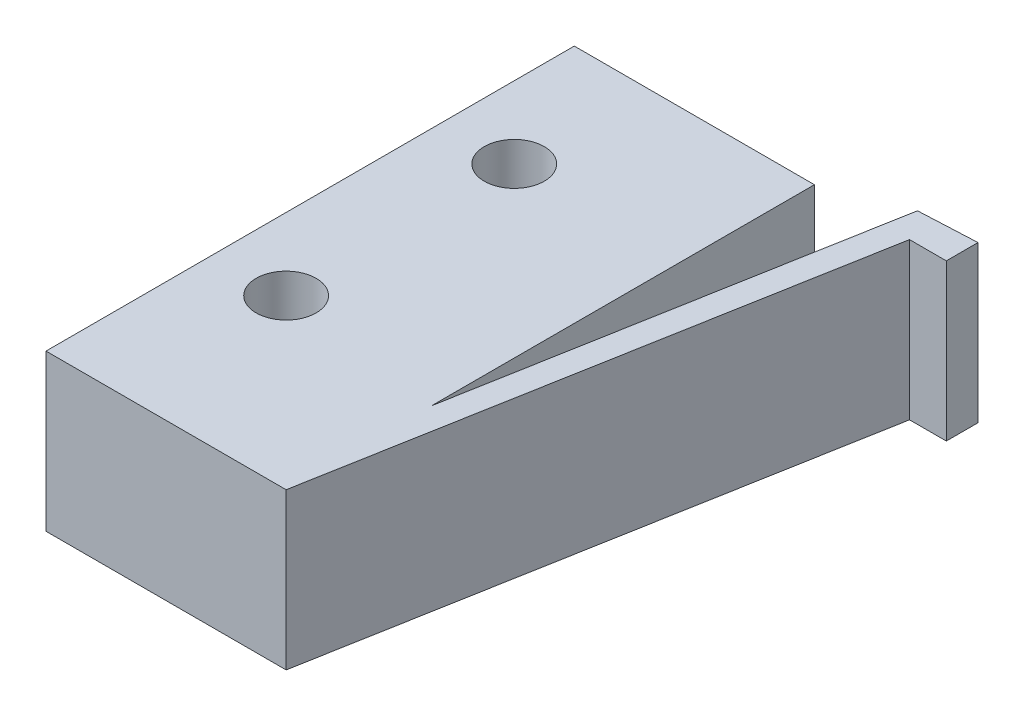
ISO-10303-21;
HEADER;
FILE_DESCRIPTION(('STEP AP214'),'2;1');
FILE_NAME('part.step','',(''),(''),'','','');
FILE_SCHEMA(('AUTOMOTIVE_DESIGN { 1 0 10303 214 1 1 1 1 }'));
ENDSEC;
DATA;
#1=APPLICATION_CONTEXT('core data for automotive mechanical design processes');
#2=APPLICATION_PROTOCOL_DEFINITION('international standard','automotive_design',2000,#1);
#3=PRODUCT_CONTEXT('',#1,'mechanical');
#4=PRODUCT('Part','Part','',(#3));
#5=PRODUCT_RELATED_PRODUCT_CATEGORY('part','',(#4));
#6=PRODUCT_DEFINITION_FORMATION('','',#4);
#7=PRODUCT_DEFINITION_CONTEXT('part definition',#1,'design');
#8=PRODUCT_DEFINITION('design','',#6,#7);
#9=PRODUCT_DEFINITION_SHAPE('','',#8);
#10=(LENGTH_UNIT() NAMED_UNIT(*) SI_UNIT(.MILLI.,.METRE.));
#11=(NAMED_UNIT(*) PLANE_ANGLE_UNIT() SI_UNIT($,.RADIAN.));
#12=(NAMED_UNIT(*) SI_UNIT($,.STERADIAN.) SOLID_ANGLE_UNIT());
#13=UNCERTAINTY_MEASURE_WITH_UNIT(LENGTH_MEASURE(1.E-05),#10,'distance_accuracy_value','');
#14=(GEOMETRIC_REPRESENTATION_CONTEXT(3) GLOBAL_UNCERTAINTY_ASSIGNED_CONTEXT((#13)) GLOBAL_UNIT_ASSIGNED_CONTEXT((#10,
#11,#12)) REPRESENTATION_CONTEXT('',''));
#15=CARTESIAN_POINT('',(0.,0.,0.));
#16=DIRECTION('',(0.,0.,1.));
#17=DIRECTION('',(1.,0.,0.));
#18=AXIS2_PLACEMENT_3D('',#15,#16,#17);
#19=CARTESIAN_POINT('',(0.,3.25,0.));
#20=DIRECTION('',(0.,-1.,0.));
#21=DIRECTION('',(0.,0.,-1.));
#22=AXIS2_PLACEMENT_3D('',#19,#20,#21);
#23=PLANE('',#22);
#24=DIRECTION('',(-0.177146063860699,0.,0.984184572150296));
#25=VECTOR('',#24,1.);
#26=CARTESIAN_POINT('',(8.08680450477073,3.25,-12.2043300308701));
#27=LINE('',#26,#25);
#28=CARTESIAN_POINT('',(8.08680450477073,3.25,-12.2043300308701));
#29=VERTEX_POINT('',#28);
#30=CARTESIAN_POINT('',(5.,3.25,4.94527693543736));
#31=VERTEX_POINT('',#30);
#32=EDGE_CURVE('E126',#29,#31,#27,.T.);
#33=ORIENTED_EDGE('',*,*,#32,.T.);
#34=DIRECTION('',(0.,0.,-1.));
#35=VECTOR('',#34,1.);
#36=CARTESIAN_POINT('',(5.,3.25,11.));
#37=LINE('',#36,#35);
#38=CARTESIAN_POINT('',(5.,3.25,-11.));
#39=VERTEX_POINT('',#38);
#40=EDGE_CURVE('E47',#31,#39,#37,.T.);
#41=ORIENTED_EDGE('',*,*,#40,.T.);
#42=DIRECTION('',(-1.,0.,0.));
#43=VECTOR('',#42,1.);
#44=CARTESIAN_POINT('',(-5.,3.25,-11.));
#45=LINE('',#44,#43);
#46=CARTESIAN_POINT('',(-5.,3.25,-11.));
#47=VERTEX_POINT('',#46);
#48=EDGE_CURVE('E161',#39,#47,#45,.T.);
#49=ORIENTED_EDGE('',*,*,#48,.T.);
#50=DIRECTION('',(0.,0.,1.));
#51=VECTOR('',#50,1.);
#52=CARTESIAN_POINT('',(-5.,3.25,11.));
#53=LINE('',#52,#51);
#54=CARTESIAN_POINT('',(-5.,3.25,11.));
#55=VERTEX_POINT('',#54);
#56=EDGE_CURVE('E164',#47,#55,#53,.T.);
#57=ORIENTED_EDGE('',*,*,#56,.T.);
#58=DIRECTION('',(1.,0.,0.));
#59=VECTOR('',#58,1.);
#60=CARTESIAN_POINT('',(-5.,3.25,11.));
#61=LINE('',#60,#59);
#62=CARTESIAN_POINT('',(5.,3.25,11.));
#63=VERTEX_POINT('',#62);
#64=EDGE_CURVE('E166',#55,#63,#61,.T.);
#65=ORIENTED_EDGE('',*,*,#64,.T.);
#66=DIRECTION('',(0.177146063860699,0.,-0.984184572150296));
#67=VECTOR('',#66,1.);
#68=CARTESIAN_POINT('',(5.,3.25,11.));
#69=LINE('',#68,#67);
#70=CARTESIAN_POINT('',(8.95983996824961,3.25,-11.));
#71=VERTEX_POINT('',#70);
#72=EDGE_CURVE('E133',#63,#71,#69,.T.);
#73=ORIENTED_EDGE('',*,*,#72,.T.);
#74=DIRECTION('',(1.,0.,0.));
#75=VECTOR('',#74,1.);
#76=CARTESIAN_POINT('',(8.95983996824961,3.25,-11.));
#77=LINE('',#76,#75);
#78=CARTESIAN_POINT('',(10.4917701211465,3.25,-11.));
#79=VERTEX_POINT('',#78);
#80=EDGE_CURVE('E118',#71,#79,#77,.T.);
#81=ORIENTED_EDGE('',*,*,#80,.T.);
#82=DIRECTION('',(0.,0.,-1.));
#83=VECTOR('',#82,1.);
#84=CARTESIAN_POINT('',(10.4917701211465,3.25,-11.));
#85=LINE('',#84,#83);
#86=CARTESIAN_POINT('',(10.4917701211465,3.25,-12.3196366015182));
#87=VERTEX_POINT('',#86);
#88=EDGE_CURVE('E209',#79,#87,#85,.T.);
#89=ORIENTED_EDGE('',*,*,#88,.T.);
#90=DIRECTION('',(-0.99885260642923,0.,0.0478901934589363));
#91=VECTOR('',#90,1.);
#92=CARTESIAN_POINT('',(10.4917701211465,3.25,-12.3196366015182));
#93=LINE('',#92,#91);
#94=EDGE_CURVE('E129',#87,#29,#93,.T.);
#95=ORIENTED_EDGE('',*,*,#94,.T.);
#96=EDGE_LOOP('',(#33,#41,#49,#57,#65,#73,#81,#89,#95));
#97=FACE_BOUND('',#96,.T.);
#98=CARTESIAN_POINT('',(-2.,3.25,-5.5));
#99=DIRECTION('',(0.,1.,0.));
#100=DIRECTION('',(0.,0.,1.));
#101=AXIS2_PLACEMENT_3D('',#98,#99,#100);
#102=CIRCLE('',#101,1.25);
#103=CARTESIAN_POINT('',(-2.,3.25,-6.75));
#104=VERTEX_POINT('',#103);
#105=EDGE_CURVE('E154',#104,#104,#102,.T.);
#106=ORIENTED_EDGE('',*,*,#105,.F.);
#107=EDGE_LOOP('',(#106));
#108=FACE_BOUND('',#107,.T.);
#109=CARTESIAN_POINT('',(-2.,3.25,4.));
#110=DIRECTION('',(0.,1.,0.));
#111=DIRECTION('',(0.,0.,1.));
#112=AXIS2_PLACEMENT_3D('',#109,#110,#111);
#113=CIRCLE('',#112,1.25);
#114=CARTESIAN_POINT('',(-2.,3.25,2.75));
#115=VERTEX_POINT('',#114);
#116=EDGE_CURVE('E148',#115,#115,#113,.T.);
#117=ORIENTED_EDGE('',*,*,#116,.F.);
#118=EDGE_LOOP('',(#117));
#119=FACE_BOUND('',#118,.T.);
#120=ADVANCED_FACE('F33',(#97,#108,#119),#23,.F.);
#121=CARTESIAN_POINT('',(0.,-3.25,0.));
#122=DIRECTION('',(0.,-1.,0.));
#123=DIRECTION('',(0.,0.,-1.));
#124=AXIS2_PLACEMENT_3D('',#121,#122,#123);
#125=PLANE('',#124);
#126=DIRECTION('',(0.,0.,-1.));
#127=VECTOR('',#126,1.);
#128=CARTESIAN_POINT('',(5.,-3.25,11.));
#129=LINE('',#128,#127);
#130=CARTESIAN_POINT('',(5.,-3.25,4.94527693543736));
#131=VERTEX_POINT('',#130);
#132=CARTESIAN_POINT('',(5.,-3.25,-11.));
#133=VERTEX_POINT('',#132);
#134=EDGE_CURVE('E157',#131,#133,#129,.T.);
#135=ORIENTED_EDGE('',*,*,#134,.F.);
#136=DIRECTION('',(-0.177146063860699,0.,0.984184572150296));
#137=VECTOR('',#136,1.);
#138=CARTESIAN_POINT('',(8.08680450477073,-3.25,-12.2043300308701));
#139=LINE('',#138,#137);
#140=CARTESIAN_POINT('',(8.08680450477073,-3.25,-12.2043300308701));
#141=VERTEX_POINT('',#140);
#142=EDGE_CURVE('E135',#141,#131,#139,.T.);
#143=ORIENTED_EDGE('',*,*,#142,.F.);
#144=DIRECTION('',(-0.99885260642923,0.,0.0478901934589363));
#145=VECTOR('',#144,1.);
#146=CARTESIAN_POINT('',(10.4917701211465,-3.25,-12.3196366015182));
#147=LINE('',#146,#145);
#148=CARTESIAN_POINT('',(10.4917701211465,-3.25,-12.3196366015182));
#149=VERTEX_POINT('',#148);
#150=EDGE_CURVE('E140',#149,#141,#147,.T.);
#151=ORIENTED_EDGE('',*,*,#150,.F.);
#152=DIRECTION('',(0.,0.,-1.));
#153=VECTOR('',#152,1.);
#154=CARTESIAN_POINT('',(10.4917701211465,-3.25,-11.));
#155=LINE('',#154,#153);
#156=CARTESIAN_POINT('',(10.4917701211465,-3.25,-11.));
#157=VERTEX_POINT('',#156);
#158=EDGE_CURVE('E109',#157,#149,#155,.T.);
#159=ORIENTED_EDGE('',*,*,#158,.F.);
#160=DIRECTION('',(1.,0.,0.));
#161=VECTOR('',#160,1.);
#162=CARTESIAN_POINT('',(8.95983996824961,-3.25,-11.));
#163=LINE('',#162,#161);
#164=CARTESIAN_POINT('',(8.95983996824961,-3.25,-11.));
#165=VERTEX_POINT('',#164);
#166=EDGE_CURVE('E100',#165,#157,#163,.T.);
#167=ORIENTED_EDGE('',*,*,#166,.F.);
#168=DIRECTION('',(0.177146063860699,0.,-0.984184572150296));
#169=VECTOR('',#168,1.);
#170=CARTESIAN_POINT('',(5.,-3.25,11.));
#171=LINE('',#170,#169);
#172=CARTESIAN_POINT('',(5.,-3.25,11.));
#173=VERTEX_POINT('',#172);
#174=EDGE_CURVE('E106',#173,#165,#171,.T.);
#175=ORIENTED_EDGE('',*,*,#174,.F.);
#176=DIRECTION('',(1.,0.,0.));
#177=VECTOR('',#176,1.);
#178=CARTESIAN_POINT('',(-5.,-3.25,11.));
#179=LINE('',#178,#177);
#180=CARTESIAN_POINT('',(-5.,-3.25,11.));
#181=VERTEX_POINT('',#180);
#182=EDGE_CURVE('E162',#181,#173,#179,.T.);
#183=ORIENTED_EDGE('',*,*,#182,.F.);
#184=DIRECTION('',(0.,0.,1.));
#185=VECTOR('',#184,1.);
#186=CARTESIAN_POINT('',(-5.,-3.25,11.));
#187=LINE('',#186,#185);
#188=CARTESIAN_POINT('',(-5.,-3.25,-11.));
#189=VERTEX_POINT('',#188);
#190=EDGE_CURVE('E171',#189,#181,#187,.T.);
#191=ORIENTED_EDGE('',*,*,#190,.F.);
#192=DIRECTION('',(-1.,0.,0.));
#193=VECTOR('',#192,1.);
#194=CARTESIAN_POINT('',(-5.,-3.25,-11.));
#195=LINE('',#194,#193);
#196=EDGE_CURVE('E169',#133,#189,#195,.T.);
#197=ORIENTED_EDGE('',*,*,#196,.F.);
#198=EDGE_LOOP('',(#135,#143,#151,#159,#167,#175,#183,#191,#197));
#199=FACE_BOUND('',#198,.T.);
#200=CARTESIAN_POINT('',(-2.,-3.25,-5.5));
#201=DIRECTION('',(0.,1.,0.));
#202=DIRECTION('',(0.,0.,1.));
#203=AXIS2_PLACEMENT_3D('',#200,#201,#202);
#204=CIRCLE('',#203,1.25);
#205=CARTESIAN_POINT('',(-2.,-3.25,-6.75));
#206=VERTEX_POINT('',#205);
#207=EDGE_CURVE('E151',#206,#206,#204,.T.);
#208=ORIENTED_EDGE('',*,*,#207,.T.);
#209=EDGE_LOOP('',(#208));
#210=FACE_BOUND('',#209,.T.);
#211=CARTESIAN_POINT('',(-2.,-3.25,4.));
#212=DIRECTION('',(0.,1.,0.));
#213=DIRECTION('',(0.,0.,1.));
#214=AXIS2_PLACEMENT_3D('',#211,#212,#213);
#215=CIRCLE('',#214,1.25);
#216=CARTESIAN_POINT('',(-2.,-3.25,2.75));
#217=VERTEX_POINT('',#216);
#218=EDGE_CURVE('E138',#217,#217,#215,.T.);
#219=ORIENTED_EDGE('',*,*,#218,.T.);
#220=EDGE_LOOP('',(#219));
#221=FACE_BOUND('',#220,.T.);
#222=ADVANCED_FACE('F102',(#199,#210,#221),#125,.T.);
#223=CARTESIAN_POINT('',(5.,3.25,11.));
#224=DIRECTION('',(-1.,0.,0.));
#225=DIRECTION('',(0.,0.,1.));
#226=AXIS2_PLACEMENT_3D('',#223,#224,#225);
#227=PLANE('',#226);
#228=ORIENTED_EDGE('',*,*,#40,.F.);
#229=DIRECTION('',(0.,-1.,0.));
#230=VECTOR('',#229,1.);
#231=CARTESIAN_POINT('',(5.,3.25,4.94527693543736));
#232=LINE('',#231,#230);
#233=EDGE_CURVE('E11',#31,#131,#232,.T.);
#234=ORIENTED_EDGE('',*,*,#233,.T.);
#235=ORIENTED_EDGE('',*,*,#134,.T.);
#236=DIRECTION('',(0.,-1.,0.));
#237=VECTOR('',#236,1.);
#238=CARTESIAN_POINT('',(5.,3.25,-11.));
#239=LINE('',#238,#237);
#240=EDGE_CURVE('E41',#39,#133,#239,.T.);
#241=ORIENTED_EDGE('',*,*,#240,.F.);
#242=EDGE_LOOP('',(#228,#234,#235,#241));
#243=FACE_BOUND('',#242,.T.);
#244=ADVANCED_FACE('F35',(#243),#227,.F.);
#245=CARTESIAN_POINT('',(-5.,3.25,-11.));
#246=DIRECTION('',(0.,0.,1.));
#247=DIRECTION('',(1.,0.,0.));
#248=AXIS2_PLACEMENT_3D('',#245,#246,#247);
#249=PLANE('',#248);
#250=ORIENTED_EDGE('',*,*,#196,.T.);
#251=DIRECTION('',(0.,-1.,0.));
#252=VECTOR('',#251,1.);
#253=CARTESIAN_POINT('',(-5.,3.25,-11.));
#254=LINE('',#253,#252);
#255=EDGE_CURVE('E178',#47,#189,#254,.T.);
#256=ORIENTED_EDGE('',*,*,#255,.F.);
#257=ORIENTED_EDGE('',*,*,#48,.F.);
#258=ORIENTED_EDGE('',*,*,#240,.T.);
#259=EDGE_LOOP('',(#250,#256,#257,#258));
#260=FACE_BOUND('',#259,.T.);
#261=ADVANCED_FACE('F183',(#260),#249,.F.);
#262=CARTESIAN_POINT('',(-5.,3.25,11.));
#263=DIRECTION('',(1.,0.,0.));
#264=DIRECTION('',(0.,0.,-1.));
#265=AXIS2_PLACEMENT_3D('',#262,#263,#264);
#266=PLANE('',#265);
#267=ORIENTED_EDGE('',*,*,#190,.T.);
#268=DIRECTION('',(0.,-1.,0.));
#269=VECTOR('',#268,1.);
#270=CARTESIAN_POINT('',(-5.,3.25,11.));
#271=LINE('',#270,#269);
#272=EDGE_CURVE('E175',#55,#181,#271,.T.);
#273=ORIENTED_EDGE('',*,*,#272,.F.);
#274=ORIENTED_EDGE('',*,*,#56,.F.);
#275=ORIENTED_EDGE('',*,*,#255,.T.);
#276=EDGE_LOOP('',(#267,#273,#274,#275));
#277=FACE_BOUND('',#276,.T.);
#278=ADVANCED_FACE('F189',(#277),#266,.F.);
#279=CARTESIAN_POINT('',(-5.,3.25,11.));
#280=DIRECTION('',(0.,0.,-1.));
#281=DIRECTION('',(-1.,0.,0.));
#282=AXIS2_PLACEMENT_3D('',#279,#280,#281);
#283=PLANE('',#282);
#284=ORIENTED_EDGE('',*,*,#182,.T.);
#285=DIRECTION('',(0.,-1.,0.));
#286=VECTOR('',#285,1.);
#287=CARTESIAN_POINT('',(5.,3.25,11.));
#288=LINE('',#287,#286);
#289=EDGE_CURVE('E125',#63,#173,#288,.T.);
#290=ORIENTED_EDGE('',*,*,#289,.F.);
#291=ORIENTED_EDGE('',*,*,#64,.F.);
#292=ORIENTED_EDGE('',*,*,#272,.T.);
#293=EDGE_LOOP('',(#284,#290,#291,#292));
#294=FACE_BOUND('',#293,.T.);
#295=ADVANCED_FACE('F193',(#294),#283,.F.);
#296=CARTESIAN_POINT('',(-2.,3.25,-5.5));
#297=DIRECTION('',(0.,-1.,0.));
#298=DIRECTION('',(0.,0.,-1.));
#299=AXIS2_PLACEMENT_3D('',#296,#297,#298);
#300=CYLINDRICAL_SURFACE('',#299,1.25);
#301=CARTESIAN_POINT('',(-2.,3.25,-6.75));
#302=CARTESIAN_POINT('',(-2.,3.18229166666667,-6.75));
#303=CARTESIAN_POINT('',(-2.,3.11458333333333,-6.75));
#304=CARTESIAN_POINT('',(-2.,2.97916666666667,-6.75));
#305=CARTESIAN_POINT('',(-2.,2.91145833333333,-6.75));
#306=CARTESIAN_POINT('',(-2.,2.77604166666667,-6.75));
#307=CARTESIAN_POINT('',(-2.,2.70833333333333,-6.75));
#308=CARTESIAN_POINT('',(-2.,2.57291666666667,-6.75));
#309=CARTESIAN_POINT('',(-2.,2.50520833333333,-6.75));
#310=CARTESIAN_POINT('',(-2.,2.36979166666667,-6.75));
#311=CARTESIAN_POINT('',(-2.,2.30208333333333,-6.75));
#312=CARTESIAN_POINT('',(-2.,2.16666666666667,-6.75));
#313=CARTESIAN_POINT('',(-2.,2.09895833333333,-6.75));
#314=CARTESIAN_POINT('',(-2.,1.96354166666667,-6.75));
#315=CARTESIAN_POINT('',(-2.,1.89583333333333,-6.75));
#316=CARTESIAN_POINT('',(-2.,1.76041666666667,-6.75));
#317=CARTESIAN_POINT('',(-2.,1.69270833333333,-6.75));
#318=CARTESIAN_POINT('',(-2.,1.55729166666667,-6.75));
#319=CARTESIAN_POINT('',(-2.,1.48958333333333,-6.75));
#320=CARTESIAN_POINT('',(-2.,1.35416666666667,-6.75));
#321=CARTESIAN_POINT('',(-2.,1.28645833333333,-6.75));
#322=CARTESIAN_POINT('',(-2.,1.15104166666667,-6.75));
#323=CARTESIAN_POINT('',(-2.,1.08333333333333,-6.75));
#324=CARTESIAN_POINT('',(-2.,0.947916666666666,-6.75));
#325=CARTESIAN_POINT('',(-2.,0.880208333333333,-6.75));
#326=CARTESIAN_POINT('',(-2.,0.744791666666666,-6.75));
#327=CARTESIAN_POINT('',(-2.,0.677083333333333,-6.75));
#328=CARTESIAN_POINT('',(-2.,0.541666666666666,-6.75));
#329=CARTESIAN_POINT('',(-2.,0.473958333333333,-6.75));
#330=CARTESIAN_POINT('',(-2.,0.338541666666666,-6.75));
#331=CARTESIAN_POINT('',(-2.,0.270833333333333,-6.75));
#332=CARTESIAN_POINT('',(-2.,0.135416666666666,-6.75));
#333=CARTESIAN_POINT('',(-2.,0.0677083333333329,-6.75));
#334=CARTESIAN_POINT('',(-2.,-0.0677083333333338,-6.75));
#335=CARTESIAN_POINT('',(-2.,-0.135416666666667,-6.75));
#336=CARTESIAN_POINT('',(-2.,-0.270833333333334,-6.75));
#337=CARTESIAN_POINT('',(-2.,-0.338541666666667,-6.75));
#338=CARTESIAN_POINT('',(-2.,-0.473958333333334,-6.75));
#339=CARTESIAN_POINT('',(-2.,-0.541666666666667,-6.75));
#340=CARTESIAN_POINT('',(-2.,-0.677083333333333,-6.75));
#341=CARTESIAN_POINT('',(-2.,-0.744791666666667,-6.75));
#342=CARTESIAN_POINT('',(-2.,-0.880208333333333,-6.75));
#343=CARTESIAN_POINT('',(-2.,-0.947916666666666,-6.75));
#344=CARTESIAN_POINT('',(-2.,-1.08333333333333,-6.75));
#345=CARTESIAN_POINT('',(-2.,-1.15104166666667,-6.75));
#346=CARTESIAN_POINT('',(-2.,-1.28645833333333,-6.75));
#347=CARTESIAN_POINT('',(-2.,-1.35416666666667,-6.75));
#348=CARTESIAN_POINT('',(-2.,-1.48958333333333,-6.75));
#349=CARTESIAN_POINT('',(-2.,-1.55729166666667,-6.75));
#350=CARTESIAN_POINT('',(-2.,-1.69270833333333,-6.75));
#351=CARTESIAN_POINT('',(-2.,-1.76041666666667,-6.75));
#352=CARTESIAN_POINT('',(-2.,-1.89583333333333,-6.75));
#353=CARTESIAN_POINT('',(-2.,-1.96354166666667,-6.75));
#354=CARTESIAN_POINT('',(-2.,-2.09895833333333,-6.75));
#355=CARTESIAN_POINT('',(-2.,-2.16666666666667,-6.75));
#356=CARTESIAN_POINT('',(-2.,-2.30208333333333,-6.75));
#357=CARTESIAN_POINT('',(-2.,-2.36979166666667,-6.75));
#358=CARTESIAN_POINT('',(-2.,-2.50520833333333,-6.75));
#359=CARTESIAN_POINT('',(-2.,-2.57291666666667,-6.75));
#360=CARTESIAN_POINT('',(-2.,-2.70833333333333,-6.75));
#361=CARTESIAN_POINT('',(-2.,-2.77604166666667,-6.75));
#362=CARTESIAN_POINT('',(-2.,-2.91145833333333,-6.75));
#363=CARTESIAN_POINT('',(-2.,-2.97916666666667,-6.75));
#364=CARTESIAN_POINT('',(-2.,-3.11458333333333,-6.75));
#365=CARTESIAN_POINT('',(-2.,-3.18229166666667,-6.75));
#366=CARTESIAN_POINT('',(-2.,-3.25,-6.75));
#367=B_SPLINE_CURVE_WITH_KNOTS('',3,(#301,#302,#303,#304,#305,#306,#307,#308,#309,#310,#311,
#312,#313,#314,#315,#316,#317,#318,#319,#320,#321,#322,#323,#324,#325,#326,#327,#328,#329,#330,
#331,#332,#333,#334,#335,#336,#337,#338,#339,#340,#341,#342,#343,#344,#345,#346,#347,#348,#349,
#350,#351,#352,#353,#354,#355,#356,#357,#358,#359,#360,#361,#362,#363,#364,#365,#366),
.UNSPECIFIED.,.F.,.F.,(4,2,2,2,2,2,2,2,2,2,2,2,2,2,2,2,2,2,2,2,2,2,2,2,2,2,2,2,2,2,2,2,4),(0.,
0.203125,0.40625,0.609375,0.8125,1.015625,1.21875,1.421875,1.625,1.828125,2.03125,2.234375,
2.4375,2.640625,2.84375,3.046875,3.25,3.453125,3.65625,3.859375,4.0625,4.265625,4.46875,
4.671875,4.875,5.078125,5.28125,5.484375,5.6875,5.890625,6.09375,6.296875,6.5),.UNSPECIFIED.);
#368=EDGE_CURVE('BSEAM227',#104,#206,#367,.T.);
#369=ORIENTED_EDGE('',*,*,#105,.T.);
#370=ORIENTED_EDGE('',*,*,#207,.F.);
#371=ORIENTED_EDGE('',*,*,#368,.T.);
#372=ORIENTED_EDGE('',*,*,#368,.F.);
#373=EDGE_LOOP('',(#369,#371,#370,#372));
#374=FACE_BOUND('',#373,.T.);
#375=ADVANCED_FACE('F227',(#374),#300,.F.);
#376=CARTESIAN_POINT('',(-2.,3.25,4.));
#377=DIRECTION('',(0.,-1.,0.));
#378=DIRECTION('',(0.,0.,-1.));
#379=AXIS2_PLACEMENT_3D('',#376,#377,#378);
#380=CYLINDRICAL_SURFACE('',#379,1.25);
#381=CARTESIAN_POINT('',(-2.,3.25,2.75));
#382=CARTESIAN_POINT('',(-2.,3.18229166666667,2.75));
#383=CARTESIAN_POINT('',(-2.,3.11458333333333,2.75));
#384=CARTESIAN_POINT('',(-2.,2.97916666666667,2.75));
#385=CARTESIAN_POINT('',(-2.,2.91145833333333,2.75));
#386=CARTESIAN_POINT('',(-2.,2.77604166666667,2.75));
#387=CARTESIAN_POINT('',(-2.,2.70833333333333,2.75));
#388=CARTESIAN_POINT('',(-2.,2.57291666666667,2.75));
#389=CARTESIAN_POINT('',(-2.,2.50520833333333,2.75));
#390=CARTESIAN_POINT('',(-2.,2.36979166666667,2.75));
#391=CARTESIAN_POINT('',(-2.,2.30208333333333,2.75));
#392=CARTESIAN_POINT('',(-2.,2.16666666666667,2.75));
#393=CARTESIAN_POINT('',(-2.,2.09895833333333,2.75));
#394=CARTESIAN_POINT('',(-2.,1.96354166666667,2.75));
#395=CARTESIAN_POINT('',(-2.,1.89583333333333,2.75));
#396=CARTESIAN_POINT('',(-2.,1.76041666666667,2.75));
#397=CARTESIAN_POINT('',(-2.,1.69270833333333,2.75));
#398=CARTESIAN_POINT('',(-2.,1.55729166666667,2.75));
#399=CARTESIAN_POINT('',(-2.,1.48958333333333,2.75));
#400=CARTESIAN_POINT('',(-2.,1.35416666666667,2.75));
#401=CARTESIAN_POINT('',(-2.,1.28645833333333,2.75));
#402=CARTESIAN_POINT('',(-2.,1.15104166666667,2.75));
#403=CARTESIAN_POINT('',(-2.,1.08333333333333,2.75));
#404=CARTESIAN_POINT('',(-2.,0.947916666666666,2.75));
#405=CARTESIAN_POINT('',(-2.,0.880208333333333,2.75));
#406=CARTESIAN_POINT('',(-2.,0.744791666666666,2.75));
#407=CARTESIAN_POINT('',(-2.,0.677083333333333,2.75));
#408=CARTESIAN_POINT('',(-2.,0.541666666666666,2.75));
#409=CARTESIAN_POINT('',(-2.,0.473958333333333,2.75));
#410=CARTESIAN_POINT('',(-2.,0.338541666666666,2.75));
#411=CARTESIAN_POINT('',(-2.,0.270833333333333,2.75));
#412=CARTESIAN_POINT('',(-2.,0.135416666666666,2.75));
#413=CARTESIAN_POINT('',(-2.,0.0677083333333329,2.75));
#414=CARTESIAN_POINT('',(-2.,-0.0677083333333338,2.75));
#415=CARTESIAN_POINT('',(-2.,-0.135416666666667,2.75));
#416=CARTESIAN_POINT('',(-2.,-0.270833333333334,2.75));
#417=CARTESIAN_POINT('',(-2.,-0.338541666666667,2.75));
#418=CARTESIAN_POINT('',(-2.,-0.473958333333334,2.75));
#419=CARTESIAN_POINT('',(-2.,-0.541666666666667,2.75));
#420=CARTESIAN_POINT('',(-2.,-0.677083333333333,2.75));
#421=CARTESIAN_POINT('',(-2.,-0.744791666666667,2.75));
#422=CARTESIAN_POINT('',(-2.,-0.880208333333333,2.75));
#423=CARTESIAN_POINT('',(-2.,-0.947916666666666,2.75));
#424=CARTESIAN_POINT('',(-2.,-1.08333333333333,2.75));
#425=CARTESIAN_POINT('',(-2.,-1.15104166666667,2.75));
#426=CARTESIAN_POINT('',(-2.,-1.28645833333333,2.75));
#427=CARTESIAN_POINT('',(-2.,-1.35416666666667,2.75));
#428=CARTESIAN_POINT('',(-2.,-1.48958333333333,2.75));
#429=CARTESIAN_POINT('',(-2.,-1.55729166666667,2.75));
#430=CARTESIAN_POINT('',(-2.,-1.69270833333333,2.75));
#431=CARTESIAN_POINT('',(-2.,-1.76041666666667,2.75));
#432=CARTESIAN_POINT('',(-2.,-1.89583333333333,2.75));
#433=CARTESIAN_POINT('',(-2.,-1.96354166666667,2.75));
#434=CARTESIAN_POINT('',(-2.,-2.09895833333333,2.75));
#435=CARTESIAN_POINT('',(-2.,-2.16666666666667,2.75));
#436=CARTESIAN_POINT('',(-2.,-2.30208333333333,2.75));
#437=CARTESIAN_POINT('',(-2.,-2.36979166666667,2.75));
#438=CARTESIAN_POINT('',(-2.,-2.50520833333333,2.75));
#439=CARTESIAN_POINT('',(-2.,-2.57291666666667,2.75));
#440=CARTESIAN_POINT('',(-2.,-2.70833333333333,2.75));
#441=CARTESIAN_POINT('',(-2.,-2.77604166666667,2.75));
#442=CARTESIAN_POINT('',(-2.,-2.91145833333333,2.75));
#443=CARTESIAN_POINT('',(-2.,-2.97916666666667,2.75));
#444=CARTESIAN_POINT('',(-2.,-3.11458333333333,2.75));
#445=CARTESIAN_POINT('',(-2.,-3.18229166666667,2.75));
#446=CARTESIAN_POINT('',(-2.,-3.25,2.75));
#447=B_SPLINE_CURVE_WITH_KNOTS('',3,(#381,#382,#383,#384,#385,#386,#387,#388,#389,#390,#391,
#392,#393,#394,#395,#396,#397,#398,#399,#400,#401,#402,#403,#404,#405,#406,#407,#408,#409,#410,
#411,#412,#413,#414,#415,#416,#417,#418,#419,#420,#421,#422,#423,#424,#425,#426,#427,#428,#429,
#430,#431,#432,#433,#434,#435,#436,#437,#438,#439,#440,#441,#442,#443,#444,#445,#446),
.UNSPECIFIED.,.F.,.F.,(4,2,2,2,2,2,2,2,2,2,2,2,2,2,2,2,2,2,2,2,2,2,2,2,2,2,2,2,2,2,2,2,4),(0.,
0.203125,0.40625,0.609375,0.8125,1.015625,1.21875,1.421875,1.625,1.828125,2.03125,2.234375,
2.4375,2.640625,2.84375,3.046875,3.25,3.453125,3.65625,3.859375,4.0625,4.265625,4.46875,
4.671875,4.875,5.078125,5.28125,5.484375,5.6875,5.890625,6.09375,6.296875,6.5),.UNSPECIFIED.);
#448=EDGE_CURVE('BSEAM257',#115,#217,#447,.T.);
#449=ORIENTED_EDGE('',*,*,#116,.T.);
#450=ORIENTED_EDGE('',*,*,#218,.F.);
#451=ORIENTED_EDGE('',*,*,#448,.T.);
#452=ORIENTED_EDGE('',*,*,#448,.F.);
#453=EDGE_LOOP('',(#449,#451,#450,#452));
#454=FACE_BOUND('',#453,.T.);
#455=ADVANCED_FACE('F257',(#454),#380,.F.);
#456=CARTESIAN_POINT('',(8.08680450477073,-27.2275130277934,-12.2043300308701));
#457=DIRECTION('',(-0.984184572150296,0.,-0.177146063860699));
#458=DIRECTION('',(-0.177146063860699,0.,0.984184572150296));
#459=AXIS2_PLACEMENT_3D('',#456,#457,#458);
#460=PLANE('',#459);
#461=ORIENTED_EDGE('',*,*,#233,.F.);
#462=ORIENTED_EDGE('',*,*,#32,.F.);
#463=DIRECTION('',(0.,1.,0.));
#464=VECTOR('',#463,1.);
#465=CARTESIAN_POINT('',(8.08680450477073,-27.2275130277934,-12.2043300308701));
#466=LINE('',#465,#464);
#467=EDGE_CURVE('E139',#141,#29,#466,.T.);
#468=ORIENTED_EDGE('',*,*,#467,.F.);
#469=ORIENTED_EDGE('',*,*,#142,.T.);
#470=EDGE_LOOP('',(#461,#462,#468,#469));
#471=FACE_BOUND('',#470,.T.);
#472=ADVANCED_FACE('F202',(#471),#460,.T.);
#473=CARTESIAN_POINT('',(5.,-27.2275130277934,11.));
#474=DIRECTION('',(0.984184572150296,0.,0.177146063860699));
#475=DIRECTION('',(0.177146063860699,0.,-0.984184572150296));
#476=AXIS2_PLACEMENT_3D('',#473,#474,#475);
#477=PLANE('',#476);
#478=ORIENTED_EDGE('',*,*,#289,.T.);
#479=ORIENTED_EDGE('',*,*,#174,.T.);
#480=DIRECTION('',(0.,1.,0.));
#481=VECTOR('',#480,1.);
#482=CARTESIAN_POINT('',(8.95983996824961,-27.2275130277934,-11.));
#483=LINE('',#482,#481);
#484=EDGE_CURVE('E113',#165,#71,#483,.T.);
#485=ORIENTED_EDGE('',*,*,#484,.T.);
#486=ORIENTED_EDGE('',*,*,#72,.F.);
#487=EDGE_LOOP('',(#478,#479,#485,#486));
#488=FACE_BOUND('',#487,.T.);
#489=ADVANCED_FACE('F123',(#488),#477,.T.);
#490=CARTESIAN_POINT('',(8.95983996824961,-27.2275130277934,-11.));
#491=DIRECTION('',(0.,0.,1.));
#492=DIRECTION('',(1.,0.,0.));
#493=AXIS2_PLACEMENT_3D('',#490,#491,#492);
#494=PLANE('',#493);
#495=ORIENTED_EDGE('',*,*,#484,.F.);
#496=ORIENTED_EDGE('',*,*,#166,.T.);
#497=DIRECTION('',(0.,1.,0.));
#498=VECTOR('',#497,1.);
#499=CARTESIAN_POINT('',(10.4917701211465,-27.2275130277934,-11.));
#500=LINE('',#499,#498);
#501=EDGE_CURVE('E112',#157,#79,#500,.T.);
#502=ORIENTED_EDGE('',*,*,#501,.T.);
#503=ORIENTED_EDGE('',*,*,#80,.F.);
#504=EDGE_LOOP('',(#495,#496,#502,#503));
#505=FACE_BOUND('',#504,.T.);
#506=ADVANCED_FACE('F116',(#505),#494,.T.);
#507=CARTESIAN_POINT('',(10.4917701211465,-27.2275130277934,-11.));
#508=DIRECTION('',(1.,0.,0.));
#509=DIRECTION('',(0.,0.,-1.));
#510=AXIS2_PLACEMENT_3D('',#507,#508,#509);
#511=PLANE('',#510);
#512=ORIENTED_EDGE('',*,*,#501,.F.);
#513=ORIENTED_EDGE('',*,*,#158,.T.);
#514=DIRECTION('',(0.,1.,0.));
#515=VECTOR('',#514,1.);
#516=CARTESIAN_POINT('',(10.4917701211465,-27.2275130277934,-12.3196366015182));
#517=LINE('',#516,#515);
#518=EDGE_CURVE('E143',#149,#87,#517,.T.);
#519=ORIENTED_EDGE('',*,*,#518,.T.);
#520=ORIENTED_EDGE('',*,*,#88,.F.);
#521=EDGE_LOOP('',(#512,#513,#519,#520));
#522=FACE_BOUND('',#521,.T.);
#523=ADVANCED_FACE('F208',(#522),#511,.T.);
#524=CARTESIAN_POINT('',(10.4917701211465,-27.2275130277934,-12.3196366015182));
#525=DIRECTION('',(-0.0478901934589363,0.,-0.99885260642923));
#526=DIRECTION('',(-0.99885260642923,0.,0.0478901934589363));
#527=AXIS2_PLACEMENT_3D('',#524,#525,#526);
#528=PLANE('',#527);
#529=ORIENTED_EDGE('',*,*,#518,.F.);
#530=ORIENTED_EDGE('',*,*,#150,.T.);
#531=ORIENTED_EDGE('',*,*,#467,.T.);
#532=ORIENTED_EDGE('',*,*,#94,.F.);
#533=EDGE_LOOP('',(#529,#530,#531,#532));
#534=FACE_BOUND('',#533,.T.);
#535=ADVANCED_FACE('F205',(#534),#528,.T.);
#536=CLOSED_SHELL('',(#120,#222,#244,#261,#278,#295,#375,#455,#472,#489,#506,#523,#535));
#537=MANIFOLD_SOLID_BREP('B2',#536);
#538=ADVANCED_BREP_SHAPE_REPRESENTATION('',(#18,#537),#14);
#539=SHAPE_DEFINITION_REPRESENTATION(#9,#538);
ENDSEC;
END-ISO-10303-21;
